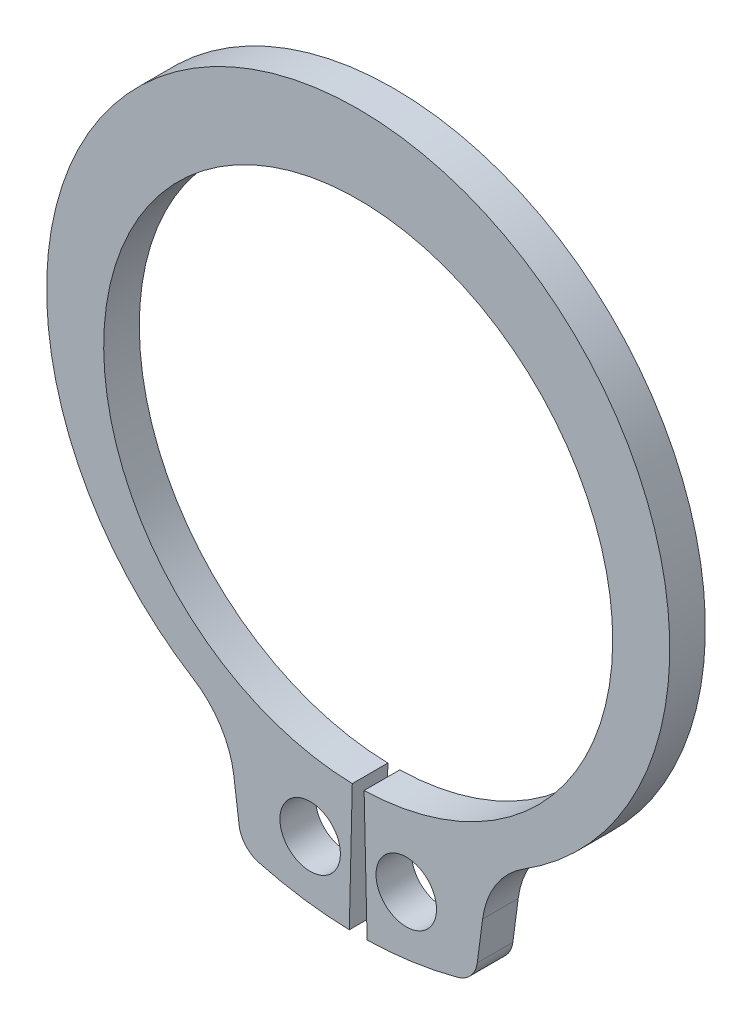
from build123d import *

# Parameters (mm, degrees)
BODYSKE_R  = 0.85
BODY_DEPTH = 1


with BuildPart() as part:
    # BodySke → Body (new body)
    with BuildSketch(Plane.XY):
        with BuildLine():
            Line((0.16627907, -7.148066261), (0.25, -10.74709263))
            ThreePointArc((0.25, -10.74709263), (1.53404529, -10.63998144), (2.7960515, -10.380009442))
            ThreePointArc((2.7960515, -10.380009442), (3.165185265, -10.149958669), (3.344561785, -9.753717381))
            Line((3.344561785, -9.753717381), (3.494820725, -8.612387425))
            ThreePointArc((3.494820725, -8.612387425), (3.86993843, -7.587908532), (4.645836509, -6.820932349))
            ThreePointArc((4.645836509, -6.820932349), (0, 9.35), (-4.645836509, -6.820932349))
            ThreePointArc((-4.645836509, -6.820932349), (-3.86993843, -7.587908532), (-3.494820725, -8.612387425))
            Line((-3.494820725, -8.612387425), (-3.344561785, -9.753717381))
            ThreePointArc((-3.344561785, -9.753717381), (-3.165185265, -10.149958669), (-2.7960515, -10.380009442))
            ThreePointArc((-2.7960515, -10.380009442), (-1.53404529, -10.63998144), (-0.25, -10.74709263))
            Line((-0.25, -10.74709263), (-0.16627907, -7.148066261))
            ThreePointArc((-0.16627907, -7.148066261), (0, 7.15), (0.16627907, -7.148066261))
        make_face()
        with Locations((1.35, -9.024584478)):
            Circle(BODYSKE_R, mode=Mode.SUBTRACT)
        with Locations((-1.35, -9.024584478)):
            Circle(BODYSKE_R, mode=Mode.SUBTRACT)
    extrude(amount=-BODY_DEPTH)


solid = part.part
